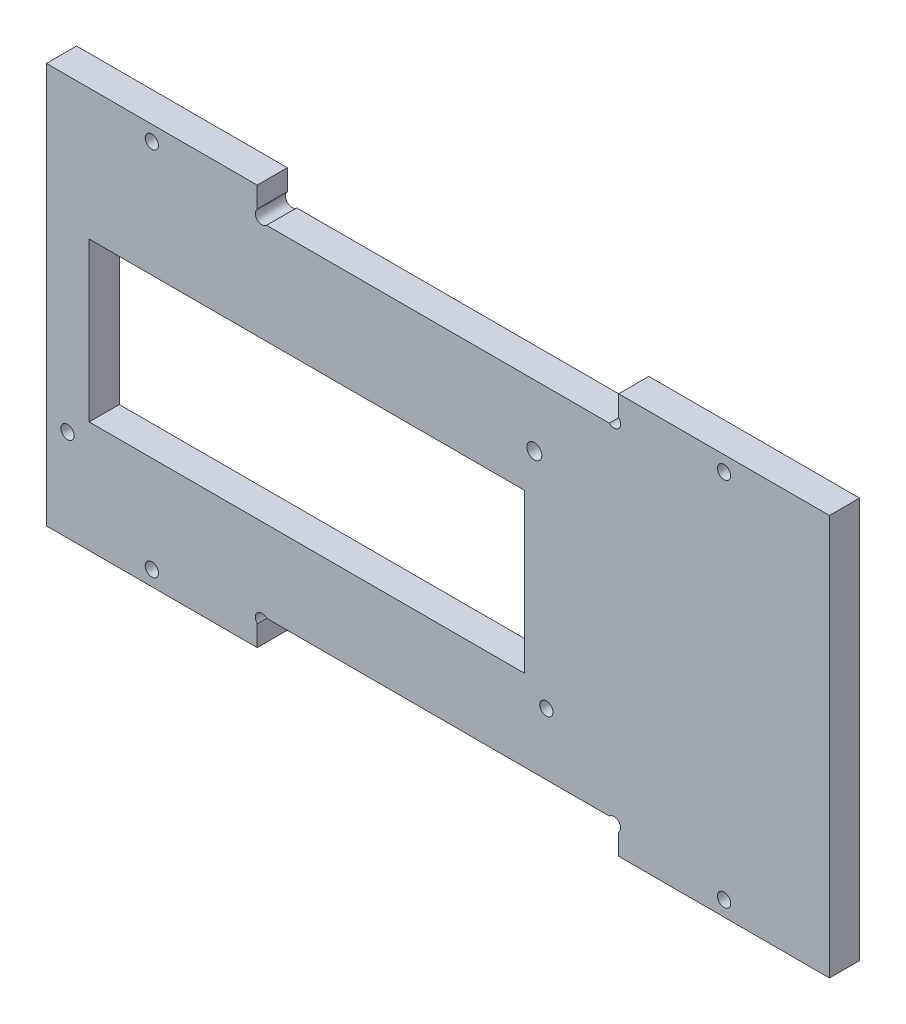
from build123d import *

# Parameters (mm, degrees)
ESQUISSE1_W               = 130
ESQUISSE1_H               = 66.5
BOSS_EXTRU_1_DEPTH        = 5
ENL_V_MAT_EXTRU_1_REACH   = 148.107
ESQUISSE2_R               = 1.25
ESQUISSE2_R_2             = 1.1
ENL_V_MAT_EXTRU_2_REACH   = 148.107
ESQUISSE3_W               = 72.3
ESQUISSE3_H               = 26.3
ENL_V_MAT_EXTRU_4_REACH   = 148.107
ESQUISSE6_W               = 60
ESQUISSE6_H               = 5
ENL_V_START               = -5
ESQUISSE7_R               = 1.1
ENL_V_MAT_EXTRU_5_DEPTH   = 5
ENL_V_MAT_EXTRU_6_REACH   = 148.107
ESQUISSE8_R               = 1.1
SYM_TRIE2_COPY_1_REACH    = 148.107
SYM_TRIE2_COPY_1_SKETCH_R = 1.1
ESQUISSE10_W              = 40
ESQUISSE10_H              = 6.5
ENL_V_MAT_EXTRU_7_DEPTH   = 1


with BuildPart() as part:
    # Esquisse1 → Boss.-Extru.1 (new body)
    with BuildSketch(Plane.XY):
        with Locations((65, 33.25)):
            Rectangle(ESQUISSE1_W, ESQUISSE1_H)
    extrude(amount=BOSS_EXTRU_1_DEPTH)

    # Esquisse2 → Enl_v. mat.-Extru.1 (cut, up to next)
    with BuildSketch(Plane.XY.offset(5), mode=Mode.PRIVATE) as enl_v_mat_extru_1_sk1:
        with Locations((81, 51.25)):
            Circle(ESQUISSE2_R)
    enl_v_mat_extru_1_tool1 = extrude(enl_v_mat_extru_1_sk1.sketch, amount=-ENL_V_MAT_EXTRU_1_REACH, mode=Mode.PRIVATE) & part.part
    # Esquisse2 → Enl_v. mat.-Extru.1 (cut, up to next)
    with BuildSketch(Plane.XY.offset(5), mode=Mode.PRIVATE) as enl_v_mat_extru_1_sk2:
        with Locations((83, 15.25)):
            Circle(ESQUISSE2_R_2)
    enl_v_mat_extru_1_tool2 = extrude(enl_v_mat_extru_1_sk2.sketch, amount=-ENL_V_MAT_EXTRU_1_REACH, mode=Mode.PRIVATE) & part.part
    # Esquisse2 → Enl_v. mat.-Extru.1 (cut, up to next)
    with BuildSketch(Plane.XY.offset(5), mode=Mode.PRIVATE) as enl_v_mat_extru_1_sk3:
        with Locations((3.5, 15.25)):
            Circle(ESQUISSE2_R_2)
    enl_v_mat_extru_1_tool3 = extrude(enl_v_mat_extru_1_sk3.sketch, amount=-ENL_V_MAT_EXTRU_1_REACH, mode=Mode.PRIVATE) & part.part
    add(enl_v_mat_extru_1_tool1.solids().sort_by_distance((81, 51.25, 5))[0], mode=Mode.SUBTRACT)
    add(enl_v_mat_extru_1_tool2.solids().sort_by_distance((83, 15.25, 5))[0], mode=Mode.SUBTRACT)
    add(enl_v_mat_extru_1_tool3.solids().sort_by_distance((3.5, 15.25, 5))[0], mode=Mode.SUBTRACT)

    # Esquisse3 → Enl_v. mat.-Extru.2 (cut, up to next)
    with BuildSketch(Plane.XY.offset(5), mode=Mode.PRIVATE) as enl_v_mat_extru_2_sk1:
        with Locations((43.25, 31.65)):
            Rectangle(ESQUISSE3_W, ESQUISSE3_H)
    enl_v_mat_extru_2_tool1 = extrude(enl_v_mat_extru_2_sk1.sketch, amount=-ENL_V_MAT_EXTRU_2_REACH, mode=Mode.PRIVATE) & part.part
    add(enl_v_mat_extru_2_tool1.solids().sort_by_distance((43.25, 31.65, 5))[0], mode=Mode.SUBTRACT)

    # Esquisse6 → Enl_v. mat.-Extru.4 (cut, up to next)
    with BuildSketch(Plane.XY.offset(5), mode=Mode.PRIVATE) as enl_v_mat_extru_4_sk1:
        with Locations((65, 2.5)):
            Rectangle(ESQUISSE6_W, ESQUISSE6_H)
    enl_v_mat_extru_4_tool1 = extrude(enl_v_mat_extru_4_sk1.sketch, amount=-ENL_V_MAT_EXTRU_4_REACH, mode=Mode.PRIVATE) & part.part
    # Esquisse6 → Enl_v. mat.-Extru.4 (cut, up to next)
    with BuildSketch(Plane.XY.offset(5), mode=Mode.PRIVATE) as enl_v_mat_extru_4_sk2:
        with Locations((65, 64)):
            Rectangle(ESQUISSE6_W, ESQUISSE6_H)
    enl_v_mat_extru_4_tool2 = extrude(enl_v_mat_extru_4_sk2.sketch, amount=-ENL_V_MAT_EXTRU_4_REACH, mode=Mode.PRIVATE) & part.part
    add(enl_v_mat_extru_4_tool1.solids().sort_by_distance((65, 2.5, 5))[0], mode=Mode.SUBTRACT)
    add(enl_v_mat_extru_4_tool2.solids().sort_by_distance((65, 64, 5))[0], mode=Mode.SUBTRACT)

    # Esquisse7 → Enl_v. mat.-Extru.5 (cut)
    with BuildSketch(Plane.XY.offset(5).offset(ENL_V_START)):
        with Locations((94.222182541, 4.222182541)):
            Circle(ESQUISSE7_R)
        with Locations((35.777817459, 4.222182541)):
            Circle(ESQUISSE7_R)
        with Locations((35.777817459, 62.277817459)):
            Circle(ESQUISSE7_R)
        with Locations((94.222182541, 62.277817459)):
            Circle(ESQUISSE7_R)
    extrude(amount=ENL_V_MAT_EXTRU_5_DEPTH, mode=Mode.SUBTRACT)

    # Esquisse8 → Enl_v. mat.-Extru.6 (cut, up to next)
    with BuildSketch(Plane.XY.offset(5), mode=Mode.PRIVATE) as enl_v_mat_extru_6_sk1:
        with Locations((17.5, 2.5)):
            Circle(ESQUISSE8_R)
    enl_v_mat_extru_6_tool1 = extrude(enl_v_mat_extru_6_sk1.sketch, amount=-ENL_V_MAT_EXTRU_6_REACH, mode=Mode.PRIVATE) & part.part
    enl_v_mat_extru_6 = enl_v_mat_extru_6_tool1.solids().sort_by_distance((17.5, 2.5, 5))[0]
    add(enl_v_mat_extru_6, mode=Mode.SUBTRACT)

    # Sym_trie1: Enl_v. mat.-Extru.6 across plane
    add(enl_v_mat_extru_6.mirror(Plane(origin=(65, 0, 0), x_dir=(0, 0, 1), z_dir=(1, 0, 0))), mode=Mode.SUBTRACT)

    # Sym_trie2: Enl_v. mat.-Extru.6 across plane
    add(enl_v_mat_extru_6.mirror(Plane.ZX.offset(33.25)), mode=Mode.SUBTRACT)

    # Sym_trie2 copy 1 sketch → Sym_trie2 copy 1 (cut, up to next)
    with BuildSketch(Plane(origin=(130, 66.5, 5), x_dir=(-1, 0, 0), z_dir=(0, 0, 1)), mode=Mode.PRIVATE) as sym_trie2_copy_1_sk1:
        with Locations((17.5, 2.5)):
            Circle(SYM_TRIE2_COPY_1_SKETCH_R)
    sym_trie2_copy_1_tool1 = extrude(sym_trie2_copy_1_sk1.sketch, amount=-SYM_TRIE2_COPY_1_REACH, mode=Mode.PRIVATE) & part.part
    add(sym_trie2_copy_1_tool1.solids().sort_by_distance((112.5, 64, 5))[0], mode=Mode.SUBTRACT)

    # Esquisse10 → Enl_v. mat.-Extru.7 (cut)
    with BuildSketch(Plane(origin=(0, 0, 0), x_dir=(-1, 0, 0), z_dir=(0, 0, -1))):
        with Locations((-58.4, 51.55)):
            Rectangle(ESQUISSE10_W, ESQUISSE10_H)
    extrude(amount=-ENL_V_MAT_EXTRU_7_DEPTH, mode=Mode.SUBTRACT)


solid = part.part
